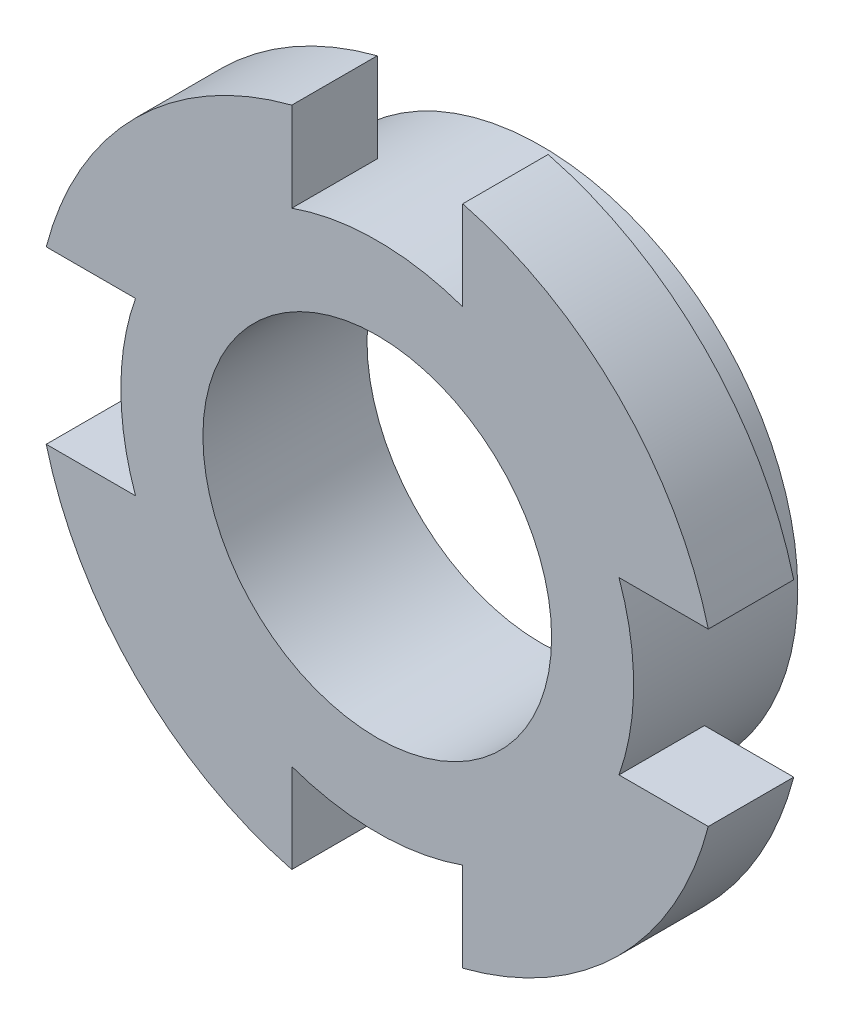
ISO-10303-21;
HEADER;
FILE_DESCRIPTION(('STEP AP214'),'2;1');
FILE_NAME('part.step','',(''),(''),'','','');
FILE_SCHEMA(('AUTOMOTIVE_DESIGN { 1 0 10303 214 1 1 1 1 }'));
ENDSEC;
DATA;
#1=APPLICATION_CONTEXT('core data for automotive mechanical design processes');
#2=APPLICATION_PROTOCOL_DEFINITION('international standard','automotive_design',2000,#1);
#3=PRODUCT_CONTEXT('',#1,'mechanical');
#4=PRODUCT('Part','Part','',(#3));
#5=PRODUCT_RELATED_PRODUCT_CATEGORY('part','',(#4));
#6=PRODUCT_DEFINITION_FORMATION('','',#4);
#7=PRODUCT_DEFINITION_CONTEXT('part definition',#1,'design');
#8=PRODUCT_DEFINITION('design','',#6,#7);
#9=PRODUCT_DEFINITION_SHAPE('','',#8);
#10=(LENGTH_UNIT() NAMED_UNIT(*) SI_UNIT(.MILLI.,.METRE.));
#11=(NAMED_UNIT(*) PLANE_ANGLE_UNIT() SI_UNIT($,.RADIAN.));
#12=(NAMED_UNIT(*) SI_UNIT($,.STERADIAN.) SOLID_ANGLE_UNIT());
#13=UNCERTAINTY_MEASURE_WITH_UNIT(LENGTH_MEASURE(1.E-05),#10,'distance_accuracy_value','');
#14=(GEOMETRIC_REPRESENTATION_CONTEXT(3) GLOBAL_UNCERTAINTY_ASSIGNED_CONTEXT((#13)) GLOBAL_UNIT_ASSIGNED_CONTEXT((#10,
#11,#12)) REPRESENTATION_CONTEXT('',''));
#15=CARTESIAN_POINT('',(0.,0.,0.));
#16=DIRECTION('',(0.,0.,1.));
#17=DIRECTION('',(1.,0.,0.));
#18=AXIS2_PLACEMENT_3D('',#15,#16,#17);
#19=CARTESIAN_POINT('',(0.,0.,11.1125));
#20=DIRECTION('',(0.,0.,1.));
#21=DIRECTION('',(1.,0.,0.));
#22=AXIS2_PLACEMENT_3D('',#19,#20,#21);
#23=PLANE('',#22);
#24=DIRECTION('',(0.,1.,0.));
#25=VECTOR('',#24,1.);
#26=CARTESIAN_POINT('',(-1.5875,0.,11.1125));
#27=LINE('',#26,#25);
#28=CARTESIAN_POINT('',(-1.5875,4.49012806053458,11.1125));
#29=VERTEX_POINT('',#28);
#30=CARTESIAN_POINT('',(-1.5875,6.14836106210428,11.1125));
#31=VERTEX_POINT('',#30);
#32=EDGE_CURVE('E243',#29,#31,#27,.T.);
#33=ORIENTED_EDGE('',*,*,#32,.F.);
#34=CARTESIAN_POINT('',(0.,0.,11.1125));
#35=DIRECTION('',(0.,0.,1.));
#36=DIRECTION('',(1.,0.,0.));
#37=AXIS2_PLACEMENT_3D('',#34,#35,#36);
#38=CIRCLE('',#37,4.7625);
#39=CARTESIAN_POINT('',(-4.49012806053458,1.5875,11.1125));
#40=VERTEX_POINT('',#39);
#41=EDGE_CURVE('E43',#29,#40,#38,.T.);
#42=ORIENTED_EDGE('',*,*,#41,.T.);
#43=DIRECTION('',(1.,0.,0.));
#44=VECTOR('',#43,1.);
#45=CARTESIAN_POINT('',(0.,1.5875,11.1125));
#46=LINE('',#45,#44);
#47=CARTESIAN_POINT('',(-6.14836106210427,1.5875,11.1125));
#48=VERTEX_POINT('',#47);
#49=EDGE_CURVE('E239',#48,#40,#46,.T.);
#50=ORIENTED_EDGE('',*,*,#49,.F.);
#51=CARTESIAN_POINT('',(0.,0.,11.1125));
#52=DIRECTION('',(0.,0.,1.));
#53=DIRECTION('',(1.,0.,0.));
#54=AXIS2_PLACEMENT_3D('',#51,#52,#53);
#55=CIRCLE('',#54,6.35);
#56=EDGE_CURVE('E261',#31,#48,#55,.T.);
#57=ORIENTED_EDGE('',*,*,#56,.F.);
#58=EDGE_LOOP('',(#33,#42,#50,#57));
#59=FACE_BOUND('',#58,.T.);
#60=ADVANCED_FACE('F34',(#59),#23,.F.);
#61=CARTESIAN_POINT('',(4.49012806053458,1.5875,11.1125));
#62=VERTEX_POINT('',#61);
#63=CARTESIAN_POINT('',(1.5875,4.49012806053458,11.1125));
#64=VERTEX_POINT('',#63);
#65=EDGE_CURVE('E11',#62,#64,#38,.T.);
#66=ORIENTED_EDGE('',*,*,#65,.T.);
#67=DIRECTION('',(0.,1.,0.));
#68=VECTOR('',#67,1.);
#69=CARTESIAN_POINT('',(1.5875,0.,11.1125));
#70=LINE('',#69,#68);
#71=CARTESIAN_POINT('',(1.5875,6.14836106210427,11.1125));
#72=VERTEX_POINT('',#71);
#73=EDGE_CURVE('E248',#64,#72,#70,.T.);
#74=ORIENTED_EDGE('',*,*,#73,.T.);
#75=CARTESIAN_POINT('',(6.14836106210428,1.5875,11.1125));
#76=VERTEX_POINT('',#75);
#77=EDGE_CURVE('E258',#76,#72,#55,.T.);
#78=ORIENTED_EDGE('',*,*,#77,.F.);
#79=DIRECTION('',(1.,0.,0.));
#80=VECTOR('',#79,1.);
#81=CARTESIAN_POINT('',(0.,1.5875,11.1125));
#82=LINE('',#81,#80);
#83=EDGE_CURVE('E220',#62,#76,#82,.T.);
#84=ORIENTED_EDGE('',*,*,#83,.F.);
#85=EDGE_LOOP('',(#66,#74,#78,#84));
#86=FACE_BOUND('',#85,.T.);
#87=ADVANCED_FACE('F325',(#86),#23,.F.);
#88=CARTESIAN_POINT('',(-6.14836106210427,-1.5875,11.1125));
#89=VERTEX_POINT('',#88);
#90=CARTESIAN_POINT('',(-1.5875,-6.14836106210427,11.1125));
#91=VERTEX_POINT('',#90);
#92=EDGE_CURVE('E279',#89,#91,#55,.T.);
#93=ORIENTED_EDGE('',*,*,#92,.F.);
#94=DIRECTION('',(1.,0.,0.));
#95=VECTOR('',#94,1.);
#96=CARTESIAN_POINT('',(0.,-1.5875,11.1125));
#97=LINE('',#96,#95);
#98=CARTESIAN_POINT('',(-4.49012806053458,-1.5875,11.1125));
#99=VERTEX_POINT('',#98);
#100=EDGE_CURVE('E234',#89,#99,#97,.T.);
#101=ORIENTED_EDGE('',*,*,#100,.T.);
#102=CARTESIAN_POINT('',(-1.5875,-4.49012806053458,11.1125));
#103=VERTEX_POINT('',#102);
#104=EDGE_CURVE('E266',#99,#103,#38,.T.);
#105=ORIENTED_EDGE('',*,*,#104,.T.);
#106=DIRECTION('',(0.,1.,0.));
#107=VECTOR('',#106,1.);
#108=CARTESIAN_POINT('',(-1.5875,0.,11.1125));
#109=LINE('',#108,#107);
#110=EDGE_CURVE('E231',#91,#103,#109,.T.);
#111=ORIENTED_EDGE('',*,*,#110,.F.);
#112=EDGE_LOOP('',(#93,#101,#105,#111));
#113=FACE_BOUND('',#112,.T.);
#114=ADVANCED_FACE('F285',(#113),#23,.F.);
#115=CARTESIAN_POINT('',(0.,0.,12.7));
#116=DIRECTION('',(0.,0.,-1.));
#117=DIRECTION('',(-1.,0.,0.));
#118=AXIS2_PLACEMENT_3D('',#115,#116,#117);
#119=CYLINDRICAL_SURFACE('',#118,6.35);
#120=DIRECTION('',(0.,0.,-1.));
#121=VECTOR('',#120,1.);
#122=CARTESIAN_POINT('',(-1.5875,6.14836106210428,12.7));
#123=LINE('',#122,#121);
#124=CARTESIAN_POINT('',(-1.5875,6.14836106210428,12.7));
#125=VERTEX_POINT('',#124);
#126=EDGE_CURVE('E241',#31,#125,#123,.F.);
#127=ORIENTED_EDGE('',*,*,#126,.F.);
#128=ORIENTED_EDGE('',*,*,#56,.T.);
#129=DIRECTION('',(0.,0.,-1.));
#130=VECTOR('',#129,1.);
#131=CARTESIAN_POINT('',(-6.14836106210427,1.5875,12.7));
#132=LINE('',#131,#130);
#133=CARTESIAN_POINT('',(-6.14836106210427,1.5875,12.7));
#134=VERTEX_POINT('',#133);
#135=EDGE_CURVE('E237',#134,#48,#132,.T.);
#136=ORIENTED_EDGE('',*,*,#135,.F.);
#137=CARTESIAN_POINT('',(0.,0.,12.7));
#138=DIRECTION('',(0.,0.,1.));
#139=DIRECTION('',(1.,0.,0.));
#140=AXIS2_PLACEMENT_3D('',#137,#138,#139);
#141=CIRCLE('',#140,6.35);
#142=EDGE_CURVE('E264',#125,#134,#141,.T.);
#143=ORIENTED_EDGE('',*,*,#142,.F.);
#144=EDGE_LOOP('',(#127,#128,#136,#143));
#145=FACE_BOUND('',#144,.T.);
#146=ADVANCED_FACE('F303',(#145),#119,.T.);
#147=ORIENTED_EDGE('',*,*,#77,.T.);
#148=DIRECTION('',(0.,0.,-1.));
#149=VECTOR('',#148,1.);
#150=CARTESIAN_POINT('',(1.5875,6.14836106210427,12.7));
#151=LINE('',#150,#149);
#152=CARTESIAN_POINT('',(1.5875,6.14836106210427,12.7));
#153=VERTEX_POINT('',#152);
#154=EDGE_CURVE('E245',#72,#153,#151,.F.);
#155=ORIENTED_EDGE('',*,*,#154,.T.);
#156=CARTESIAN_POINT('',(6.14836106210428,1.5875,12.7));
#157=VERTEX_POINT('',#156);
#158=EDGE_CURVE('E262',#157,#153,#141,.T.);
#159=ORIENTED_EDGE('',*,*,#158,.F.);
#160=DIRECTION('',(0.,0.,-1.));
#161=VECTOR('',#160,1.);
#162=CARTESIAN_POINT('',(6.14836106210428,1.5875,12.7));
#163=LINE('',#162,#161);
#164=EDGE_CURVE('E218',#76,#157,#163,.F.);
#165=ORIENTED_EDGE('',*,*,#164,.F.);
#166=EDGE_LOOP('',(#147,#155,#159,#165));
#167=FACE_BOUND('',#166,.T.);
#168=ADVANCED_FACE('F345',(#167),#119,.T.);
#169=CARTESIAN_POINT('',(-6.14836106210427,-1.5875,12.7));
#170=VERTEX_POINT('',#169);
#171=CARTESIAN_POINT('',(-1.5875,-6.14836106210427,12.7));
#172=VERTEX_POINT('',#171);
#173=EDGE_CURVE('E268',#170,#172,#141,.T.);
#174=ORIENTED_EDGE('',*,*,#173,.F.);
#175=DIRECTION('',(0.,0.,-1.));
#176=VECTOR('',#175,1.);
#177=CARTESIAN_POINT('',(-6.14836106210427,-1.5875,12.7));
#178=LINE('',#177,#176);
#179=EDGE_CURVE('E59',#170,#89,#178,.T.);
#180=ORIENTED_EDGE('',*,*,#179,.T.);
#181=ORIENTED_EDGE('',*,*,#92,.T.);
#182=DIRECTION('',(0.,0.,-1.));
#183=VECTOR('',#182,1.);
#184=CARTESIAN_POINT('',(-1.5875,-6.14836106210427,12.7));
#185=LINE('',#184,#183);
#186=EDGE_CURVE('E229',#172,#91,#185,.T.);
#187=ORIENTED_EDGE('',*,*,#186,.F.);
#188=EDGE_LOOP('',(#174,#180,#181,#187));
#189=FACE_BOUND('',#188,.T.);
#190=ADVANCED_FACE('F276',(#189),#119,.T.);
#191=CARTESIAN_POINT('',(0.,0.,12.7));
#192=DIRECTION('',(0.,0.,1.));
#193=DIRECTION('',(1.,0.,0.));
#194=AXIS2_PLACEMENT_3D('',#191,#192,#193);
#195=PLANE('',#194);
#196=DIRECTION('',(0.,-1.,0.));
#197=VECTOR('',#196,1.);
#198=CARTESIAN_POINT('',(1.5875,6.48793781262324,12.7));
#199=LINE('',#198,#197);
#200=CARTESIAN_POINT('',(1.5875,4.49012806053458,12.7));
#201=VERTEX_POINT('',#200);
#202=EDGE_CURVE('E202',#153,#201,#199,.T.);
#203=ORIENTED_EDGE('',*,*,#202,.T.);
#204=CARTESIAN_POINT('',(0.,0.,12.7));
#205=DIRECTION('',(0.,0.,-1.));
#206=DIRECTION('',(-1.,0.,0.));
#207=AXIS2_PLACEMENT_3D('',#204,#205,#206);
#208=CIRCLE('',#207,4.7625);
#209=CARTESIAN_POINT('',(-1.5875,4.49012806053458,12.7));
#210=VERTEX_POINT('',#209);
#211=EDGE_CURVE('E199',#210,#201,#208,.T.);
#212=ORIENTED_EDGE('',*,*,#211,.F.);
#213=DIRECTION('',(0.,-1.,0.));
#214=VECTOR('',#213,1.);
#215=CARTESIAN_POINT('',(-1.5875,6.48793781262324,12.7));
#216=LINE('',#215,#214);
#217=EDGE_CURVE('E197',#125,#210,#216,.T.);
#218=ORIENTED_EDGE('',*,*,#217,.F.);
#219=ORIENTED_EDGE('',*,*,#142,.T.);
#220=DIRECTION('',(-1.,0.,0.));
#221=VECTOR('',#220,1.);
#222=CARTESIAN_POINT('',(-4.49012806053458,1.5875,12.7));
#223=LINE('',#222,#221);
#224=CARTESIAN_POINT('',(-4.49012806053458,1.5875,12.7));
#225=VERTEX_POINT('',#224);
#226=EDGE_CURVE('E195',#225,#134,#223,.T.);
#227=ORIENTED_EDGE('',*,*,#226,.F.);
#228=CARTESIAN_POINT('',(0.,0.,12.7));
#229=DIRECTION('',(0.,0.,-1.));
#230=DIRECTION('',(-1.,0.,0.));
#231=AXIS2_PLACEMENT_3D('',#228,#229,#230);
#232=CIRCLE('',#231,4.7625);
#233=CARTESIAN_POINT('',(-4.49012806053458,-1.5875,12.7));
#234=VERTEX_POINT('',#233);
#235=EDGE_CURVE('E192',#234,#225,#232,.T.);
#236=ORIENTED_EDGE('',*,*,#235,.F.);
#237=DIRECTION('',(-1.,0.,0.));
#238=VECTOR('',#237,1.);
#239=CARTESIAN_POINT('',(-4.49012806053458,-1.5875,12.7));
#240=LINE('',#239,#238);
#241=EDGE_CURVE('E190',#234,#170,#240,.T.);
#242=ORIENTED_EDGE('',*,*,#241,.T.);
#243=ORIENTED_EDGE('',*,*,#173,.T.);
#244=DIRECTION('',(0.,-1.,0.));
#245=VECTOR('',#244,1.);
#246=CARTESIAN_POINT('',(-1.5875,-4.49012806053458,12.7));
#247=LINE('',#246,#245);
#248=CARTESIAN_POINT('',(-1.5875,-4.49012806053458,12.7));
#249=VERTEX_POINT('',#248);
#250=EDGE_CURVE('E188',#249,#172,#247,.T.);
#251=ORIENTED_EDGE('',*,*,#250,.F.);
#252=CARTESIAN_POINT('',(0.,0.,12.7));
#253=DIRECTION('',(0.,0.,-1.));
#254=DIRECTION('',(-1.,0.,0.));
#255=AXIS2_PLACEMENT_3D('',#252,#253,#254);
#256=CIRCLE('',#255,4.7625);
#257=CARTESIAN_POINT('',(1.5875,-4.49012806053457,12.7));
#258=VERTEX_POINT('',#257);
#259=EDGE_CURVE('E182',#258,#249,#256,.T.);
#260=ORIENTED_EDGE('',*,*,#259,.F.);
#261=DIRECTION('',(0.,-1.,0.));
#262=VECTOR('',#261,1.);
#263=CARTESIAN_POINT('',(1.5875,-4.49012806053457,12.7));
#264=LINE('',#263,#262);
#265=CARTESIAN_POINT('',(1.5875,-6.14836106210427,12.7));
#266=VERTEX_POINT('',#265);
#267=EDGE_CURVE('E180',#258,#266,#264,.T.);
#268=ORIENTED_EDGE('',*,*,#267,.T.);
#269=CARTESIAN_POINT('',(6.14836106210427,-1.5875,12.7));
#270=VERTEX_POINT('',#269);
#271=EDGE_CURVE('E179',#266,#270,#141,.T.);
#272=ORIENTED_EDGE('',*,*,#271,.T.);
#273=DIRECTION('',(-1.,0.,0.));
#274=VECTOR('',#273,1.);
#275=CARTESIAN_POINT('',(6.48793781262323,-1.5875,12.7));
#276=LINE('',#275,#274);
#277=CARTESIAN_POINT('',(4.49012806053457,-1.5875,12.7));
#278=VERTEX_POINT('',#277);
#279=EDGE_CURVE('E154',#270,#278,#276,.T.);
#280=ORIENTED_EDGE('',*,*,#279,.T.);
#281=CARTESIAN_POINT('',(0.,0.,12.7));
#282=DIRECTION('',(0.,0.,-1.));
#283=DIRECTION('',(-1.,0.,0.));
#284=AXIS2_PLACEMENT_3D('',#281,#282,#283);
#285=CIRCLE('',#284,4.7625);
#286=CARTESIAN_POINT('',(4.49012806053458,1.5875,12.7));
#287=VERTEX_POINT('',#286);
#288=EDGE_CURVE('E166',#287,#278,#285,.T.);
#289=ORIENTED_EDGE('',*,*,#288,.F.);
#290=DIRECTION('',(-1.,0.,0.));
#291=VECTOR('',#290,1.);
#292=CARTESIAN_POINT('',(6.48793781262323,1.5875,12.7));
#293=LINE('',#292,#291);
#294=EDGE_CURVE('E172',#157,#287,#293,.T.);
#295=ORIENTED_EDGE('',*,*,#294,.F.);
#296=ORIENTED_EDGE('',*,*,#158,.T.);
#297=EDGE_LOOP('',(#203,#212,#218,#219,#227,#236,#242,#243,#251,#260,#268,#272,#280,#289,#295,#296));
#298=FACE_BOUND('',#297,.T.);
#299=CARTESIAN_POINT('',(0.,0.,12.7));
#300=DIRECTION('',(0.,0.,1.));
#301=DIRECTION('',(1.,0.,0.));
#302=AXIS2_PLACEMENT_3D('',#299,#300,#301);
#303=CIRCLE('',#302,3.2385);
#304=CARTESIAN_POINT('',(3.2385,0.,12.7));
#305=VERTEX_POINT('',#304);
#306=EDGE_CURVE('E254',#305,#305,#303,.T.);
#307=ORIENTED_EDGE('',*,*,#306,.F.);
#308=EDGE_LOOP('',(#307));
#309=FACE_BOUND('',#308,.T.);
#310=ADVANCED_FACE('F176',(#298,#309),#195,.T.);
#311=CARTESIAN_POINT('',(0.,0.,11.1125));
#312=DIRECTION('',(0.,0.,-1.));
#313=DIRECTION('',(-1.,0.,0.));
#314=AXIS2_PLACEMENT_3D('',#311,#312,#313);
#315=CYLINDRICAL_SURFACE('',#314,4.7625);
#316=DIRECTION('',(0.,0.,-1.));
#317=VECTOR('',#316,1.);
#318=CARTESIAN_POINT('',(1.5875,4.49012806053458,12.7));
#319=LINE('',#318,#317);
#320=EDGE_CURVE('E216',#201,#64,#319,.T.);
#321=ORIENTED_EDGE('',*,*,#320,.T.);
#322=ORIENTED_EDGE('',*,*,#65,.F.);
#323=DIRECTION('',(0.,0.,-1.));
#324=VECTOR('',#323,1.);
#325=CARTESIAN_POINT('',(4.49012806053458,1.5875,12.7));
#326=LINE('',#325,#324);
#327=EDGE_CURVE('E162',#287,#62,#326,.T.);
#328=ORIENTED_EDGE('',*,*,#327,.F.);
#329=ORIENTED_EDGE('',*,*,#288,.T.);
#330=DIRECTION('',(0.,0.,-1.));
#331=VECTOR('',#330,1.);
#332=CARTESIAN_POINT('',(4.49012806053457,-1.5875,12.7));
#333=LINE('',#332,#331);
#334=CARTESIAN_POINT('',(4.49012806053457,-1.5875,11.1125));
#335=VERTEX_POINT('',#334);
#336=EDGE_CURVE('E150',#278,#335,#333,.T.);
#337=ORIENTED_EDGE('',*,*,#336,.T.);
#338=CARTESIAN_POINT('',(1.5875,-4.49012806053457,11.1125));
#339=VERTEX_POINT('',#338);
#340=EDGE_CURVE('E44',#339,#335,#38,.T.);
#341=ORIENTED_EDGE('',*,*,#340,.F.);
#342=DIRECTION('',(0.,0.,-1.));
#343=VECTOR('',#342,1.);
#344=CARTESIAN_POINT('',(1.5875,-4.49012806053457,12.7));
#345=LINE('',#344,#343);
#346=EDGE_CURVE('E161',#258,#339,#345,.T.);
#347=ORIENTED_EDGE('',*,*,#346,.F.);
#348=ORIENTED_EDGE('',*,*,#259,.T.);
#349=DIRECTION('',(0.,0.,-1.));
#350=VECTOR('',#349,1.);
#351=CARTESIAN_POINT('',(-1.5875,-4.49012806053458,12.7));
#352=LINE('',#351,#350);
#353=EDGE_CURVE('E206',#249,#103,#352,.T.);
#354=ORIENTED_EDGE('',*,*,#353,.T.);
#355=ORIENTED_EDGE('',*,*,#104,.F.);
#356=DIRECTION('',(0.,0.,-1.));
#357=VECTOR('',#356,1.);
#358=CARTESIAN_POINT('',(-4.49012806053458,-1.5875,12.7));
#359=LINE('',#358,#357);
#360=EDGE_CURVE('E209',#234,#99,#359,.T.);
#361=ORIENTED_EDGE('',*,*,#360,.F.);
#362=ORIENTED_EDGE('',*,*,#235,.T.);
#363=DIRECTION('',(0.,0.,-1.));
#364=VECTOR('',#363,1.);
#365=CARTESIAN_POINT('',(-4.49012806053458,1.5875,12.7));
#366=LINE('',#365,#364);
#367=EDGE_CURVE('E211',#225,#40,#366,.T.);
#368=ORIENTED_EDGE('',*,*,#367,.T.);
#369=ORIENTED_EDGE('',*,*,#41,.F.);
#370=DIRECTION('',(0.,0.,-1.));
#371=VECTOR('',#370,1.);
#372=CARTESIAN_POINT('',(-1.5875,4.49012806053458,12.7));
#373=LINE('',#372,#371);
#374=EDGE_CURVE('E214',#210,#29,#373,.T.);
#375=ORIENTED_EDGE('',*,*,#374,.F.);
#376=ORIENTED_EDGE('',*,*,#211,.T.);
#377=EDGE_LOOP('',(#321,#322,#328,#329,#337,#341,#347,#348,#354,#355,#361,#362,#368,#369,#375,#376));
#378=FACE_BOUND('',#377,.T.);
#379=CARTESIAN_POINT('',(0.,0.,9.65199999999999));
#380=DIRECTION('',(0.,0.,-1.));
#381=DIRECTION('',(-1.,0.,0.));
#382=AXIS2_PLACEMENT_3D('',#379,#380,#381);
#383=CIRCLE('',#382,4.7625);
#384=CARTESIAN_POINT('',(-4.7625,0.,9.65199999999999));
#385=VERTEX_POINT('',#384);
#386=EDGE_CURVE('E251',#385,#385,#383,.T.);
#387=ORIENTED_EDGE('',*,*,#386,.F.);
#388=EDGE_LOOP('',(#387));
#389=FACE_BOUND('',#388,.T.);
#390=ADVANCED_FACE('F36',(#378,#389),#315,.T.);
#391=CARTESIAN_POINT('',(0.,0.,0.));
#392=DIRECTION('',(0.,0.,1.));
#393=DIRECTION('',(1.,0.,0.));
#394=AXIS2_PLACEMENT_3D('',#391,#392,#393);
#395=CYLINDRICAL_SURFACE('',#394,3.2385);
#396=ORIENTED_EDGE('',*,*,#306,.T.);
#397=EDGE_LOOP('',(#396));
#398=FACE_BOUND('',#397,.T.);
#399=CARTESIAN_POINT('',(0.,0.,9.65199999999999));
#400=DIRECTION('',(0.,0.,-1.));
#401=DIRECTION('',(-1.,0.,0.));
#402=AXIS2_PLACEMENT_3D('',#399,#400,#401);
#403=CIRCLE('',#402,3.2385);
#404=CARTESIAN_POINT('',(-3.2385,0.,9.65199999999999));
#405=VERTEX_POINT('',#404);
#406=EDGE_CURVE('E38',#405,#405,#403,.F.);
#407=ORIENTED_EDGE('',*,*,#406,.F.);
#408=EDGE_LOOP('',(#407));
#409=FACE_BOUND('',#408,.T.);
#410=ADVANCED_FACE('F334',(#398,#409),#395,.F.);
#411=CARTESIAN_POINT('',(1.5875,-6.14836106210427,11.1125));
#412=VERTEX_POINT('',#411);
#413=CARTESIAN_POINT('',(6.14836106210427,-1.5875,11.1125));
#414=VERTEX_POINT('',#413);
#415=EDGE_CURVE('E257',#412,#414,#55,.T.);
#416=ORIENTED_EDGE('',*,*,#415,.F.);
#417=DIRECTION('',(0.,1.,0.));
#418=VECTOR('',#417,1.);
#419=CARTESIAN_POINT('',(1.5875,0.,11.1125));
#420=LINE('',#419,#418);
#421=EDGE_CURVE('E226',#412,#339,#420,.T.);
#422=ORIENTED_EDGE('',*,*,#421,.T.);
#423=ORIENTED_EDGE('',*,*,#340,.T.);
#424=DIRECTION('',(1.,0.,0.));
#425=VECTOR('',#424,1.);
#426=CARTESIAN_POINT('',(0.,-1.5875,11.1125));
#427=LINE('',#426,#425);
#428=EDGE_CURVE('E157',#335,#414,#427,.T.);
#429=ORIENTED_EDGE('',*,*,#428,.T.);
#430=EDGE_LOOP('',(#416,#422,#423,#429));
#431=FACE_BOUND('',#430,.T.);
#432=ADVANCED_FACE('F312',(#431),#23,.F.);
#433=ORIENTED_EDGE('',*,*,#271,.F.);
#434=DIRECTION('',(0.,0.,-1.));
#435=VECTOR('',#434,1.);
#436=CARTESIAN_POINT('',(1.5875,-6.14836106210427,12.7));
#437=LINE('',#436,#435);
#438=EDGE_CURVE('E51',#266,#412,#437,.T.);
#439=ORIENTED_EDGE('',*,*,#438,.T.);
#440=ORIENTED_EDGE('',*,*,#415,.T.);
#441=DIRECTION('',(0.,0.,-1.));
#442=VECTOR('',#441,1.);
#443=CARTESIAN_POINT('',(6.14836106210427,-1.5875,12.7));
#444=LINE('',#443,#442);
#445=EDGE_CURVE('E222',#414,#270,#444,.F.);
#446=ORIENTED_EDGE('',*,*,#445,.T.);
#447=EDGE_LOOP('',(#433,#439,#440,#446));
#448=FACE_BOUND('',#447,.T.);
#449=ADVANCED_FACE('F310',(#448),#119,.T.);
#450=CARTESIAN_POINT('',(0.,0.,9.65199999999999));
#451=DIRECTION('',(0.,0.,-1.));
#452=DIRECTION('',(-1.,0.,0.));
#453=AXIS2_PLACEMENT_3D('',#450,#451,#452);
#454=PLANE('',#453);
#455=ORIENTED_EDGE('',*,*,#406,.T.);
#456=EDGE_LOOP('',(#455));
#457=FACE_BOUND('',#456,.T.);
#458=ORIENTED_EDGE('',*,*,#386,.T.);
#459=EDGE_LOOP('',(#458));
#460=FACE_BOUND('',#459,.T.);
#461=ADVANCED_FACE('F339',(#457,#460),#454,.T.);
#462=CARTESIAN_POINT('',(6.48793781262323,1.5875,12.7));
#463=DIRECTION('',(0.,-1.,0.));
#464=DIRECTION('',(1.,0.,0.));
#465=AXIS2_PLACEMENT_3D('',#462,#463,#464);
#466=PLANE('',#465);
#467=ORIENTED_EDGE('',*,*,#83,.T.);
#468=ORIENTED_EDGE('',*,*,#164,.T.);
#469=ORIENTED_EDGE('',*,*,#294,.T.);
#470=ORIENTED_EDGE('',*,*,#327,.T.);
#471=EDGE_LOOP('',(#467,#468,#469,#470));
#472=FACE_BOUND('',#471,.T.);
#473=ADVANCED_FACE('F322',(#472),#466,.T.);
#474=CARTESIAN_POINT('',(6.48793781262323,-1.5875,12.7));
#475=DIRECTION('',(0.,-1.,0.));
#476=DIRECTION('',(0.,0.,-1.));
#477=AXIS2_PLACEMENT_3D('',#474,#475,#476);
#478=PLANE('',#477);
#479=ORIENTED_EDGE('',*,*,#336,.F.);
#480=ORIENTED_EDGE('',*,*,#279,.F.);
#481=ORIENTED_EDGE('',*,*,#445,.F.);
#482=ORIENTED_EDGE('',*,*,#428,.F.);
#483=EDGE_LOOP('',(#479,#480,#481,#482));
#484=FACE_BOUND('',#483,.T.);
#485=ADVANCED_FACE('F152',(#484),#478,.F.);
#486=CARTESIAN_POINT('',(1.5875,-4.49012806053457,12.7));
#487=DIRECTION('',(1.,0.,0.));
#488=DIRECTION('',(0.,1.,0.));
#489=AXIS2_PLACEMENT_3D('',#486,#487,#488);
#490=PLANE('',#489);
#491=ORIENTED_EDGE('',*,*,#438,.F.);
#492=ORIENTED_EDGE('',*,*,#267,.F.);
#493=ORIENTED_EDGE('',*,*,#346,.T.);
#494=ORIENTED_EDGE('',*,*,#421,.F.);
#495=EDGE_LOOP('',(#491,#492,#493,#494));
#496=FACE_BOUND('',#495,.T.);
#497=ADVANCED_FACE('F313',(#496),#490,.F.);
#498=CARTESIAN_POINT('',(-1.5875,-4.49012806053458,12.7));
#499=DIRECTION('',(1.,0.,0.));
#500=DIRECTION('',(0.,1.,0.));
#501=AXIS2_PLACEMENT_3D('',#498,#499,#500);
#502=PLANE('',#501);
#503=ORIENTED_EDGE('',*,*,#110,.T.);
#504=ORIENTED_EDGE('',*,*,#353,.F.);
#505=ORIENTED_EDGE('',*,*,#250,.T.);
#506=ORIENTED_EDGE('',*,*,#186,.T.);
#507=EDGE_LOOP('',(#503,#504,#505,#506));
#508=FACE_BOUND('',#507,.T.);
#509=ADVANCED_FACE('F282',(#508),#502,.T.);
#510=CARTESIAN_POINT('',(-4.49012806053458,-1.5875,12.7));
#511=DIRECTION('',(0.,-1.,0.));
#512=DIRECTION('',(0.,0.,-1.));
#513=AXIS2_PLACEMENT_3D('',#510,#511,#512);
#514=PLANE('',#513);
#515=ORIENTED_EDGE('',*,*,#179,.F.);
#516=ORIENTED_EDGE('',*,*,#241,.F.);
#517=ORIENTED_EDGE('',*,*,#360,.T.);
#518=ORIENTED_EDGE('',*,*,#100,.F.);
#519=EDGE_LOOP('',(#515,#516,#517,#518));
#520=FACE_BOUND('',#519,.T.);
#521=ADVANCED_FACE('F320',(#520),#514,.F.);
#522=CARTESIAN_POINT('',(-4.49012806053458,1.5875,12.7));
#523=DIRECTION('',(0.,-1.,0.));
#524=DIRECTION('',(0.,0.,-1.));
#525=AXIS2_PLACEMENT_3D('',#522,#523,#524);
#526=PLANE('',#525);
#527=ORIENTED_EDGE('',*,*,#49,.T.);
#528=ORIENTED_EDGE('',*,*,#367,.F.);
#529=ORIENTED_EDGE('',*,*,#226,.T.);
#530=ORIENTED_EDGE('',*,*,#135,.T.);
#531=EDGE_LOOP('',(#527,#528,#529,#530));
#532=FACE_BOUND('',#531,.T.);
#533=ADVANCED_FACE('F298',(#532),#526,.T.);
#534=CARTESIAN_POINT('',(1.5875,6.48793781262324,12.7));
#535=DIRECTION('',(1.,0.,0.));
#536=DIRECTION('',(0.,1.,0.));
#537=AXIS2_PLACEMENT_3D('',#534,#535,#536);
#538=PLANE('',#537);
#539=ORIENTED_EDGE('',*,*,#320,.F.);
#540=ORIENTED_EDGE('',*,*,#202,.F.);
#541=ORIENTED_EDGE('',*,*,#154,.F.);
#542=ORIENTED_EDGE('',*,*,#73,.F.);
#543=EDGE_LOOP('',(#539,#540,#541,#542));
#544=FACE_BOUND('',#543,.T.);
#545=ADVANCED_FACE('F439',(#544),#538,.F.);
#546=CARTESIAN_POINT('',(-1.5875,6.48793781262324,12.7));
#547=DIRECTION('',(1.,0.,0.));
#548=DIRECTION('',(0.,1.,0.));
#549=AXIS2_PLACEMENT_3D('',#546,#547,#548);
#550=PLANE('',#549);
#551=ORIENTED_EDGE('',*,*,#32,.T.);
#552=ORIENTED_EDGE('',*,*,#126,.T.);
#553=ORIENTED_EDGE('',*,*,#217,.T.);
#554=ORIENTED_EDGE('',*,*,#374,.T.);
#555=EDGE_LOOP('',(#551,#552,#553,#554));
#556=FACE_BOUND('',#555,.T.);
#557=ADVANCED_FACE('F306',(#556),#550,.T.);
#558=CLOSED_SHELL('',(#60,#87,#114,#146,#168,#190,#310,#390,#410,#432,#449,#461,#473,#485,#497,
#509,#521,#533,#545,#557));
#559=MANIFOLD_SOLID_BREP('B2',#558);
#560=ADVANCED_BREP_SHAPE_REPRESENTATION('',(#18,#559),#14);
#561=SHAPE_DEFINITION_REPRESENTATION(#9,#560);
ENDSEC;
END-ISO-10303-21;
